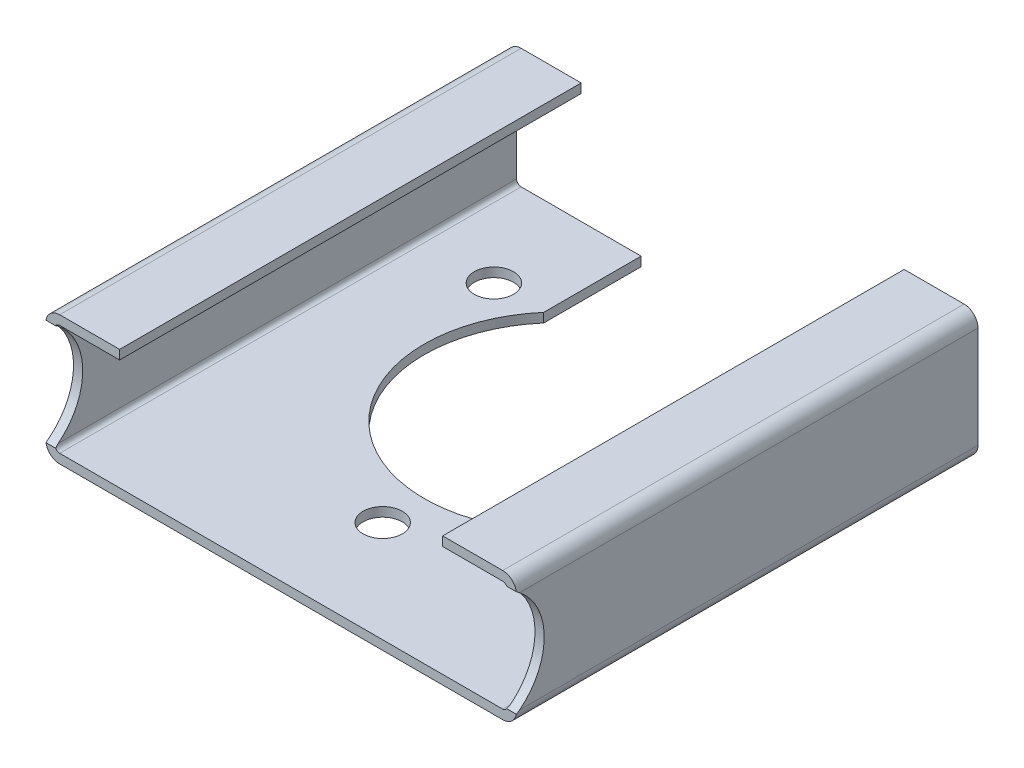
ISO-10303-21;
HEADER;
FILE_DESCRIPTION(('STEP AP214'),'2;1');
FILE_NAME('part.step','',(''),(''),'','','');
FILE_SCHEMA(('AUTOMOTIVE_DESIGN { 1 0 10303 214 1 1 1 1 }'));
ENDSEC;
DATA;
#1=APPLICATION_CONTEXT('core data for automotive mechanical design processes');
#2=APPLICATION_PROTOCOL_DEFINITION('international standard','automotive_design',2000,#1);
#3=PRODUCT_CONTEXT('',#1,'mechanical');
#4=PRODUCT('Part','Part','',(#3));
#5=PRODUCT_RELATED_PRODUCT_CATEGORY('part','',(#4));
#6=PRODUCT_DEFINITION_FORMATION('','',#4);
#7=PRODUCT_DEFINITION_CONTEXT('part definition',#1,'design');
#8=PRODUCT_DEFINITION('design','',#6,#7);
#9=PRODUCT_DEFINITION_SHAPE('','',#8);
#10=(LENGTH_UNIT() NAMED_UNIT(*) SI_UNIT(.MILLI.,.METRE.));
#11=(NAMED_UNIT(*) PLANE_ANGLE_UNIT() SI_UNIT($,.RADIAN.));
#12=(NAMED_UNIT(*) SI_UNIT($,.STERADIAN.) SOLID_ANGLE_UNIT());
#13=UNCERTAINTY_MEASURE_WITH_UNIT(LENGTH_MEASURE(1.E-05),#10,'distance_accuracy_value','');
#14=(GEOMETRIC_REPRESENTATION_CONTEXT(3) GLOBAL_UNCERTAINTY_ASSIGNED_CONTEXT((#13)) GLOBAL_UNIT_ASSIGNED_CONTEXT((#10,
#11,#12)) REPRESENTATION_CONTEXT('',''));
#15=CARTESIAN_POINT('',(0.,0.,0.));
#16=DIRECTION('',(0.,0.,1.));
#17=DIRECTION('',(1.,0.,0.));
#18=AXIS2_PLACEMENT_3D('',#15,#16,#17);
#19=CARTESIAN_POINT('',(3.,25.,-100.));
#20=DIRECTION('',(0.,0.,1.));
#21=DIRECTION('',(1.,0.,0.));
#22=AXIS2_PLACEMENT_3D('',#19,#20,#21);
#23=PLANE('',#22);
#24=DIRECTION('',(1.,0.,0.));
#25=VECTOR('',#24,1.);
#26=CARTESIAN_POINT('',(3.00000000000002,0.,-100.));
#27=LINE('',#26,#25);
#28=CARTESIAN_POINT('',(73.,0.,-100.));
#29=VERTEX_POINT('',#28);
#30=CARTESIAN_POINT('',(99.,0.,-100.));
#31=VERTEX_POINT('',#30);
#32=EDGE_CURVE('E236',#29,#31,#27,.T.);
#33=ORIENTED_EDGE('',*,*,#32,.F.);
#34=DIRECTION('',(0.,-1.,0.));
#35=VECTOR('',#34,1.);
#36=CARTESIAN_POINT('',(73.,28.001,-100.));
#37=LINE('',#36,#35);
#38=CARTESIAN_POINT('',(73.,2.,-100.));
#39=VERTEX_POINT('',#38);
#40=EDGE_CURVE('E220',#39,#29,#37,.T.);
#41=ORIENTED_EDGE('',*,*,#40,.F.);
#42=DIRECTION('',(-1.,0.,0.));
#43=VECTOR('',#42,1.);
#44=CARTESIAN_POINT('',(3.00000000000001,2.,-100.));
#45=LINE('',#44,#43);
#46=CARTESIAN_POINT('',(99.,2.,-100.));
#47=VERTEX_POINT('',#46);
#48=EDGE_CURVE('E233',#47,#39,#45,.T.);
#49=ORIENTED_EDGE('',*,*,#48,.F.);
#50=CARTESIAN_POINT('',(99.,3.,-100.));
#51=DIRECTION('',(0.,0.,-1.));
#52=DIRECTION('',(-1.,0.,0.));
#53=AXIS2_PLACEMENT_3D('',#50,#51,#52);
#54=CIRCLE('',#53,1.);
#55=CARTESIAN_POINT('',(100.,3.00000000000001,-100.));
#56=VERTEX_POINT('',#55);
#57=EDGE_CURVE('E249',#56,#47,#54,.T.);
#58=ORIENTED_EDGE('',*,*,#57,.F.);
#59=DIRECTION('',(0.,-1.,0.));
#60=VECTOR('',#59,1.);
#61=CARTESIAN_POINT('',(100.,3.00000000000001,-100.));
#62=LINE('',#61,#60);
#63=CARTESIAN_POINT('',(100.,25.,-100.));
#64=VERTEX_POINT('',#63);
#65=EDGE_CURVE('E408',#64,#56,#62,.T.);
#66=ORIENTED_EDGE('',*,*,#65,.F.);
#67=CARTESIAN_POINT('',(99.,25.,-100.));
#68=DIRECTION('',(0.,0.,-1.));
#69=DIRECTION('',(1.,0.,0.));
#70=AXIS2_PLACEMENT_3D('',#67,#68,#69);
#71=CIRCLE('',#70,1.);
#72=CARTESIAN_POINT('',(99.,26.,-100.));
#73=VERTEX_POINT('',#72);
#74=EDGE_CURVE('E406',#73,#64,#71,.T.);
#75=ORIENTED_EDGE('',*,*,#74,.F.);
#76=DIRECTION('',(1.,0.,0.));
#77=VECTOR('',#76,1.);
#78=CARTESIAN_POINT('',(86.,26.,-100.));
#79=LINE('',#78,#77);
#80=CARTESIAN_POINT('',(86.,26.,-100.));
#81=VERTEX_POINT('',#80);
#82=EDGE_CURVE('E403',#81,#73,#79,.T.);
#83=ORIENTED_EDGE('',*,*,#82,.F.);
#84=DIRECTION('',(0.,-1.,0.));
#85=VECTOR('',#84,1.);
#86=CARTESIAN_POINT('',(86.,28.,-100.));
#87=LINE('',#86,#85);
#88=CARTESIAN_POINT('',(86.,28.,-100.));
#89=VERTEX_POINT('',#88);
#90=EDGE_CURVE('E400',#89,#81,#87,.T.);
#91=ORIENTED_EDGE('',*,*,#90,.F.);
#92=DIRECTION('',(-1.,0.,0.));
#93=VECTOR('',#92,1.);
#94=CARTESIAN_POINT('',(86.,28.,-100.));
#95=LINE('',#94,#93);
#96=CARTESIAN_POINT('',(99.,28.,-100.));
#97=VERTEX_POINT('',#96);
#98=EDGE_CURVE('E397',#97,#89,#95,.T.);
#99=ORIENTED_EDGE('',*,*,#98,.F.);
#100=CARTESIAN_POINT('',(99.,25.,-100.));
#101=DIRECTION('',(0.,0.,1.));
#102=DIRECTION('',(-1.,0.,0.));
#103=AXIS2_PLACEMENT_3D('',#100,#101,#102);
#104=CIRCLE('',#103,3.);
#105=CARTESIAN_POINT('',(102.,25.,-100.));
#106=VERTEX_POINT('',#105);
#107=EDGE_CURVE('E394',#106,#97,#104,.T.);
#108=ORIENTED_EDGE('',*,*,#107,.F.);
#109=DIRECTION('',(0.,1.,0.));
#110=VECTOR('',#109,1.);
#111=CARTESIAN_POINT('',(102.,3.00000000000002,-100.));
#112=LINE('',#111,#110);
#113=CARTESIAN_POINT('',(102.,3.00000000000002,-100.));
#114=VERTEX_POINT('',#113);
#115=EDGE_CURVE('E391',#114,#106,#112,.T.);
#116=ORIENTED_EDGE('',*,*,#115,.F.);
#117=CARTESIAN_POINT('',(99.,3.,-100.));
#118=DIRECTION('',(0.,0.,1.));
#119=DIRECTION('',(-1.,0.,0.));
#120=AXIS2_PLACEMENT_3D('',#117,#118,#119);
#121=CIRCLE('',#120,3.);
#122=EDGE_CURVE('E389',#31,#114,#121,.T.);
#123=ORIENTED_EDGE('',*,*,#122,.F.);
#124=EDGE_LOOP('',(#33,#41,#49,#58,#66,#75,#83,#91,#99,#108,#116,#123));
#125=FACE_BOUND('',#124,.T.);
#126=ADVANCED_FACE('F32',(#125),#23,.F.);
#127=CARTESIAN_POINT('',(3.,25.,0.));
#128=DIRECTION('',(0.,0.,1.));
#129=DIRECTION('',(1.,0.,0.));
#130=AXIS2_PLACEMENT_3D('',#127,#128,#129);
#131=PLANE('',#130);
#132=DIRECTION('',(1.,0.,0.));
#133=VECTOR('',#132,1.);
#134=CARTESIAN_POINT('',(0.,2.51087470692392,0.));
#135=LINE('',#134,#133);
#136=CARTESIAN_POINT('',(0.0401424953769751,2.51087470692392,0.));
#137=VERTEX_POINT('',#136);
#138=CARTESIAN_POINT('',(2.12778646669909,2.51087470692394,0.));
#139=VERTEX_POINT('',#138);
#140=EDGE_CURVE('E11',#137,#139,#135,.T.);
#141=ORIENTED_EDGE('',*,*,#140,.F.);
#142=CARTESIAN_POINT('',(3.,3.,0.));
#143=DIRECTION('',(0.,0.,1.));
#144=DIRECTION('',(-1.,0.,0.));
#145=AXIS2_PLACEMENT_3D('',#142,#143,#144);
#146=CIRCLE('',#145,3.);
#147=CARTESIAN_POINT('',(3.00000000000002,0.,0.));
#148=VERTEX_POINT('',#147);
#149=EDGE_CURVE('E343',#137,#148,#146,.T.);
#150=ORIENTED_EDGE('',*,*,#149,.T.);
#151=DIRECTION('',(1.,0.,0.));
#152=VECTOR('',#151,1.);
#153=CARTESIAN_POINT('',(3.00000000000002,0.,0.));
#154=LINE('',#153,#152);
#155=CARTESIAN_POINT('',(99.,0.,0.));
#156=VERTEX_POINT('',#155);
#157=EDGE_CURVE('E338',#148,#156,#154,.T.);
#158=ORIENTED_EDGE('',*,*,#157,.T.);
#159=CARTESIAN_POINT('',(99.,3.,0.));
#160=DIRECTION('',(0.,0.,1.));
#161=DIRECTION('',(-1.,0.,0.));
#162=AXIS2_PLACEMENT_3D('',#159,#160,#161);
#163=CIRCLE('',#162,3.);
#164=CARTESIAN_POINT('',(101.959857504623,2.51087470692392,0.));
#165=VERTEX_POINT('',#164);
#166=EDGE_CURVE('E330',#156,#165,#163,.T.);
#167=ORIENTED_EDGE('',*,*,#166,.T.);
#168=CARTESIAN_POINT('',(99.8722135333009,2.51087470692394,0.));
#169=VERTEX_POINT('',#168);
#170=EDGE_CURVE('E36',#169,#165,#135,.T.);
#171=ORIENTED_EDGE('',*,*,#170,.F.);
#172=CARTESIAN_POINT('',(99.,3.,0.));
#173=DIRECTION('',(0.,0.,-1.));
#174=DIRECTION('',(-1.,0.,0.));
#175=AXIS2_PLACEMENT_3D('',#172,#173,#174);
#176=CIRCLE('',#175,1.);
#177=CARTESIAN_POINT('',(99.,2.,0.));
#178=VERTEX_POINT('',#177);
#179=EDGE_CURVE('E358',#169,#178,#176,.T.);
#180=ORIENTED_EDGE('',*,*,#179,.T.);
#181=DIRECTION('',(-1.,0.,0.));
#182=VECTOR('',#181,1.);
#183=CARTESIAN_POINT('',(3.00000000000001,2.,0.));
#184=LINE('',#183,#182);
#185=CARTESIAN_POINT('',(3.00000000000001,2.,0.));
#186=VERTEX_POINT('',#185);
#187=EDGE_CURVE('E360',#178,#186,#184,.T.);
#188=ORIENTED_EDGE('',*,*,#187,.T.);
#189=CARTESIAN_POINT('',(3.,3.,0.));
#190=DIRECTION('',(0.,0.,-1.));
#191=DIRECTION('',(-1.,0.,0.));
#192=AXIS2_PLACEMENT_3D('',#189,#190,#191);
#193=CIRCLE('',#192,1.);
#194=EDGE_CURVE('E363',#186,#139,#193,.T.);
#195=ORIENTED_EDGE('',*,*,#194,.T.);
#196=EDGE_LOOP('',(#141,#150,#158,#167,#171,#180,#188,#195));
#197=FACE_BOUND('',#196,.T.);
#198=ADVANCED_FACE('F336',(#197),#131,.T.);
#199=DIRECTION('',(1.,0.,0.));
#200=VECTOR('',#199,1.);
#201=CARTESIAN_POINT('',(0.,25.4891252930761,0.));
#202=LINE('',#201,#200);
#203=CARTESIAN_POINT('',(101.959857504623,25.4891252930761,0.));
#204=VERTEX_POINT('',#203);
#205=CARTESIAN_POINT('',(99.8722135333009,25.4891252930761,0.));
#206=VERTEX_POINT('',#205);
#207=EDGE_CURVE('E311',#204,#206,#202,.F.);
#208=ORIENTED_EDGE('',*,*,#207,.F.);
#209=CARTESIAN_POINT('',(99.,25.,0.));
#210=DIRECTION('',(0.,0.,1.));
#211=DIRECTION('',(-1.,0.,0.));
#212=AXIS2_PLACEMENT_3D('',#209,#210,#211);
#213=CIRCLE('',#212,3.);
#214=CARTESIAN_POINT('',(99.,28.,0.));
#215=VERTEX_POINT('',#214);
#216=EDGE_CURVE('E339',#204,#215,#213,.T.);
#217=ORIENTED_EDGE('',*,*,#216,.T.);
#218=DIRECTION('',(-1.,0.,0.));
#219=VECTOR('',#218,1.);
#220=CARTESIAN_POINT('',(86.,28.,0.));
#221=LINE('',#220,#219);
#222=CARTESIAN_POINT('',(86.,28.,0.));
#223=VERTEX_POINT('',#222);
#224=EDGE_CURVE('E341',#215,#223,#221,.T.);
#225=ORIENTED_EDGE('',*,*,#224,.T.);
#226=DIRECTION('',(0.,-1.,0.));
#227=VECTOR('',#226,1.);
#228=CARTESIAN_POINT('',(86.,28.,0.));
#229=LINE('',#228,#227);
#230=CARTESIAN_POINT('',(86.,26.,0.));
#231=VERTEX_POINT('',#230);
#232=EDGE_CURVE('E349',#223,#231,#229,.T.);
#233=ORIENTED_EDGE('',*,*,#232,.T.);
#234=DIRECTION('',(1.,0.,0.));
#235=VECTOR('',#234,1.);
#236=CARTESIAN_POINT('',(86.,26.,0.));
#237=LINE('',#236,#235);
#238=CARTESIAN_POINT('',(99.,26.,0.));
#239=VERTEX_POINT('',#238);
#240=EDGE_CURVE('E352',#231,#239,#237,.T.);
#241=ORIENTED_EDGE('',*,*,#240,.T.);
#242=CARTESIAN_POINT('',(99.,25.,0.));
#243=DIRECTION('',(0.,0.,-1.));
#244=DIRECTION('',(1.,0.,0.));
#245=AXIS2_PLACEMENT_3D('',#242,#243,#244);
#246=CIRCLE('',#245,1.);
#247=EDGE_CURVE('E355',#239,#206,#246,.T.);
#248=ORIENTED_EDGE('',*,*,#247,.T.);
#249=EDGE_LOOP('',(#208,#217,#225,#233,#241,#248));
#250=FACE_BOUND('',#249,.T.);
#251=ADVANCED_FACE('F566',(#250),#131,.T.);
#252=CARTESIAN_POINT('',(16.,28.,-100.));
#253=DIRECTION('',(1.,0.,0.));
#254=DIRECTION('',(0.,0.,-1.));
#255=AXIS2_PLACEMENT_3D('',#252,#253,#254);
#256=PLANE('',#255);
#257=DIRECTION('',(0.,1.,0.));
#258=VECTOR('',#257,1.);
#259=CARTESIAN_POINT('',(16.,28.,0.));
#260=LINE('',#259,#258);
#261=CARTESIAN_POINT('',(16.,26.,0.));
#262=VERTEX_POINT('',#261);
#263=CARTESIAN_POINT('',(16.,28.,0.));
#264=VERTEX_POINT('',#263);
#265=EDGE_CURVE('E333',#262,#264,#260,.T.);
#266=ORIENTED_EDGE('',*,*,#265,.F.);
#267=DIRECTION('',(0.,0.,1.));
#268=VECTOR('',#267,1.);
#269=CARTESIAN_POINT('',(16.,26.,-100.));
#270=LINE('',#269,#268);
#271=CARTESIAN_POINT('',(16.,26.,-100.));
#272=VERTEX_POINT('',#271);
#273=EDGE_CURVE('E262',#272,#262,#270,.T.);
#274=ORIENTED_EDGE('',*,*,#273,.F.);
#275=DIRECTION('',(0.,1.,0.));
#276=VECTOR('',#275,1.);
#277=CARTESIAN_POINT('',(16.,28.,-100.));
#278=LINE('',#277,#276);
#279=CARTESIAN_POINT('',(16.,28.,-100.));
#280=VERTEX_POINT('',#279);
#281=EDGE_CURVE('E371',#272,#280,#278,.T.);
#282=ORIENTED_EDGE('',*,*,#281,.T.);
#283=DIRECTION('',(0.,0.,1.));
#284=VECTOR('',#283,1.);
#285=CARTESIAN_POINT('',(16.,28.,-100.));
#286=LINE('',#285,#284);
#287=EDGE_CURVE('E261',#280,#264,#286,.T.);
#288=ORIENTED_EDGE('',*,*,#287,.T.);
#289=EDGE_LOOP('',(#266,#274,#282,#288));
#290=FACE_BOUND('',#289,.T.);
#291=ADVANCED_FACE('F34',(#290),#256,.T.);
#292=CARTESIAN_POINT('',(3.00000000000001,26.,-100.));
#293=DIRECTION('',(0.,-1.,0.));
#294=DIRECTION('',(1.,0.,0.));
#295=AXIS2_PLACEMENT_3D('',#292,#293,#294);
#296=PLANE('',#295);
#297=DIRECTION('',(1.,0.,0.));
#298=VECTOR('',#297,1.);
#299=CARTESIAN_POINT('',(3.00000000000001,26.,0.));
#300=LINE('',#299,#298);
#301=CARTESIAN_POINT('',(3.00000000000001,26.,0.));
#302=VERTEX_POINT('',#301);
#303=EDGE_CURVE('E368',#302,#262,#300,.T.);
#304=ORIENTED_EDGE('',*,*,#303,.F.);
#305=DIRECTION('',(0.,0.,1.));
#306=VECTOR('',#305,1.);
#307=CARTESIAN_POINT('',(3.00000000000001,26.,-100.));
#308=LINE('',#307,#306);
#309=CARTESIAN_POINT('',(3.00000000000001,26.,-100.));
#310=VERTEX_POINT('',#309);
#311=EDGE_CURVE('E265',#310,#302,#308,.T.);
#312=ORIENTED_EDGE('',*,*,#311,.F.);
#313=DIRECTION('',(1.,0.,0.));
#314=VECTOR('',#313,1.);
#315=CARTESIAN_POINT('',(3.00000000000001,26.,-100.));
#316=LINE('',#315,#314);
#317=EDGE_CURVE('E258',#310,#272,#316,.T.);
#318=ORIENTED_EDGE('',*,*,#317,.T.);
#319=ORIENTED_EDGE('',*,*,#273,.T.);
#320=EDGE_LOOP('',(#304,#312,#318,#319));
#321=FACE_BOUND('',#320,.T.);
#322=ADVANCED_FACE('F599',(#321),#296,.T.);
#323=CARTESIAN_POINT('',(3.,25.,-100.));
#324=DIRECTION('',(0.,0.,1.));
#325=DIRECTION('',(1.,0.,0.));
#326=AXIS2_PLACEMENT_3D('',#323,#324,#325);
#327=CYLINDRICAL_SURFACE('',#326,1.);
#328=CARTESIAN_POINT('',(2.,25.,-0.660254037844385));
#329=CARTESIAN_POINT('',(2.00002286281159,25.043179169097,-0.605415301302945));
#330=CARTESIAN_POINT('',(2.0027955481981,25.0859335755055,-0.550259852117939));
#331=CARTESIAN_POINT('',(2.01366186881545,25.1701108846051,-0.43998692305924));
#332=CARTESIAN_POINT('',(2.02172327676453,25.2115402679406,-0.384871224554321));
#333=CARTESIAN_POINT('',(2.04299250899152,25.2931130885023,-0.274677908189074));
#334=CARTESIAN_POINT('',(2.05620042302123,25.3332565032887,-0.21960029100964));
#335=CARTESIAN_POINT('',(2.08794805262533,25.4122735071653,-0.109541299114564));
#336=CARTESIAN_POINT('',(2.10651967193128,25.4511379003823,-0.0545625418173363));
#337=CARTESIAN_POINT('',(2.12778646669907,25.489125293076,0.));
#338=B_SPLINE_CURVE_WITH_KNOTS('',3,(#328,#329,#330,#331,#332,#333,#334,#335,#336,#337),
.UNSPECIFIED.,.F.,.F.,(4,2,2,2,4),(0.,0.209317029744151,0.417370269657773,0.625427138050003,
0.834747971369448),.UNSPECIFIED.);
#339=CARTESIAN_POINT('',(2.,25.,-0.660254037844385));
#340=VERTEX_POINT('',#339);
#341=CARTESIAN_POINT('',(2.12778646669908,25.4891252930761,0.));
#342=VERTEX_POINT('',#341);
#343=EDGE_CURVE('E55',#340,#342,#338,.T.);
#344=ORIENTED_EDGE('',*,*,#343,.F.);
#345=DIRECTION('',(0.,0.,1.));
#346=VECTOR('',#345,1.);
#347=CARTESIAN_POINT('',(2.,25.,-100.));
#348=LINE('',#347,#346);
#349=CARTESIAN_POINT('',(2.,25.,-100.));
#350=VERTEX_POINT('',#349);
#351=EDGE_CURVE('E268',#350,#340,#348,.T.);
#352=ORIENTED_EDGE('',*,*,#351,.F.);
#353=CARTESIAN_POINT('',(3.,25.,-100.));
#354=DIRECTION('',(0.,0.,-1.));
#355=DIRECTION('',(1.,0.,0.));
#356=AXIS2_PLACEMENT_3D('',#353,#354,#355);
#357=CIRCLE('',#356,1.);
#358=EDGE_CURVE('E255',#350,#310,#357,.T.);
#359=ORIENTED_EDGE('',*,*,#358,.T.);
#360=ORIENTED_EDGE('',*,*,#311,.T.);
#361=CARTESIAN_POINT('',(3.,25.,0.));
#362=DIRECTION('',(0.,0.,-1.));
#363=DIRECTION('',(1.,0.,0.));
#364=AXIS2_PLACEMENT_3D('',#361,#362,#363);
#365=CIRCLE('',#364,1.);
#366=EDGE_CURVE('E366',#342,#302,#365,.T.);
#367=ORIENTED_EDGE('',*,*,#366,.F.);
#368=EDGE_LOOP('',(#344,#352,#359,#360,#367));
#369=FACE_BOUND('',#368,.T.);
#370=ADVANCED_FACE('F592',(#369),#327,.F.);
#371=CARTESIAN_POINT('',(2.,3.00000000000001,-100.));
#372=DIRECTION('',(1.,0.,0.));
#373=DIRECTION('',(0.,0.,-1.));
#374=AXIS2_PLACEMENT_3D('',#371,#372,#373);
#375=PLANE('',#374);
#376=CARTESIAN_POINT('',(2.,14.,7.99999999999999));
#377=DIRECTION('',(1.,0.,0.));
#378=DIRECTION('',(0.,0.,-1.));
#379=AXIS2_PLACEMENT_3D('',#376,#377,#378);
#380=CIRCLE('',#379,14.);
#381=CARTESIAN_POINT('',(2.,3.00000000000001,-0.660254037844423));
#382=VERTEX_POINT('',#381);
#383=EDGE_CURVE('E587',#382,#340,#380,.T.);
#384=ORIENTED_EDGE('',*,*,#383,.F.);
#385=DIRECTION('',(0.,0.,1.));
#386=VECTOR('',#385,1.);
#387=CARTESIAN_POINT('',(2.,3.00000000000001,-100.));
#388=LINE('',#387,#386);
#389=CARTESIAN_POINT('',(2.,3.00000000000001,-100.));
#390=VERTEX_POINT('',#389);
#391=EDGE_CURVE('E271',#390,#382,#388,.T.);
#392=ORIENTED_EDGE('',*,*,#391,.F.);
#393=DIRECTION('',(0.,1.,0.));
#394=VECTOR('',#393,1.);
#395=CARTESIAN_POINT('',(2.,3.00000000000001,-100.));
#396=LINE('',#395,#394);
#397=EDGE_CURVE('E247',#390,#350,#396,.T.);
#398=ORIENTED_EDGE('',*,*,#397,.T.);
#399=ORIENTED_EDGE('',*,*,#351,.T.);
#400=EDGE_LOOP('',(#384,#392,#398,#399));
#401=FACE_BOUND('',#400,.T.);
#402=ADVANCED_FACE('F594',(#401),#375,.T.);
#403=CARTESIAN_POINT('',(3.,3.,-100.));
#404=DIRECTION('',(0.,0.,1.));
#405=DIRECTION('',(1.,0.,0.));
#406=AXIS2_PLACEMENT_3D('',#403,#404,#405);
#407=CYLINDRICAL_SURFACE('',#406,1.);
#408=CARTESIAN_POINT('',(2.12778646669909,2.51087470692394,0.));
#409=CARTESIAN_POINT('',(2.10651967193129,2.54886209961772,-0.0545625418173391));
#410=CARTESIAN_POINT('',(2.08794805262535,2.58772649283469,-0.109541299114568));
#411=CARTESIAN_POINT('',(2.05620042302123,2.66674349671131,-0.21960029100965));
#412=CARTESIAN_POINT('',(2.04299250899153,2.70688691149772,-0.274677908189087));
#413=CARTESIAN_POINT('',(2.02172327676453,2.78845973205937,-0.384871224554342));
#414=CARTESIAN_POINT('',(2.01366186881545,2.82988911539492,-0.439986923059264));
#415=CARTESIAN_POINT('',(2.0027955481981,2.9140664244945,-0.550259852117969));
#416=CARTESIAN_POINT('',(2.00002286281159,2.95682083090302,-0.605415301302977));
#417=CARTESIAN_POINT('',(2.,3.00000000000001,-0.66025403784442));
#418=B_SPLINE_CURVE_WITH_KNOTS('',3,(#408,#409,#410,#411,#412,#413,#414,#415,#416,#417),
.UNSPECIFIED.,.F.,.F.,(4,2,2,2,4),(0.,0.209320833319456,0.417377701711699,0.625430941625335,
0.834747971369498),.UNSPECIFIED.);
#419=EDGE_CURVE('E490',#139,#382,#418,.T.);
#420=ORIENTED_EDGE('',*,*,#419,.F.);
#421=ORIENTED_EDGE('',*,*,#194,.F.);
#422=DIRECTION('',(0.,0.,1.));
#423=VECTOR('',#422,1.);
#424=CARTESIAN_POINT('',(3.00000000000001,2.,-100.));
#425=LINE('',#424,#423);
#426=CARTESIAN_POINT('',(3.00000000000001,2.,-100.));
#427=VERTEX_POINT('',#426);
#428=EDGE_CURVE('E274',#427,#186,#425,.T.);
#429=ORIENTED_EDGE('',*,*,#428,.F.);
#430=CARTESIAN_POINT('',(3.,3.,-100.));
#431=DIRECTION('',(0.,0.,-1.));
#432=DIRECTION('',(-1.,0.,0.));
#433=AXIS2_PLACEMENT_3D('',#430,#431,#432);
#434=CIRCLE('',#433,1.);
#435=EDGE_CURVE('E243',#427,#390,#434,.T.);
#436=ORIENTED_EDGE('',*,*,#435,.T.);
#437=ORIENTED_EDGE('',*,*,#391,.T.);
#438=EDGE_LOOP('',(#420,#421,#429,#436,#437));
#439=FACE_BOUND('',#438,.T.);
#440=ADVANCED_FACE('F584',(#439),#407,.F.);
#441=CARTESIAN_POINT('',(3.00000000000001,2.,-100.));
#442=DIRECTION('',(0.,1.,0.));
#443=DIRECTION('',(0.,0.,1.));
#444=AXIS2_PLACEMENT_3D('',#441,#442,#443);
#445=PLANE('',#444);
#446=CARTESIAN_POINT('',(18.0910346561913,2.,-78.9999999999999));
#447=DIRECTION('',(0.,1.,0.));
#448=DIRECTION('',(0.,0.,1.));
#449=AXIS2_PLACEMENT_3D('',#446,#447,#448);
#450=CIRCLE('',#449,4.25000000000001);
#451=CARTESIAN_POINT('',(18.0910346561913,2.,-83.2499999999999));
#452=VERTEX_POINT('',#451);
#453=EDGE_CURVE('E838',#452,#452,#450,.F.);
#454=ORIENTED_EDGE('',*,*,#453,.T.);
#455=EDGE_LOOP('',(#454));
#456=FACE_BOUND('',#455,.T.);
#457=CARTESIAN_POINT('',(83.9089653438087,2.,-79.));
#458=DIRECTION('',(0.,1.,0.));
#459=DIRECTION('',(0.,0.,1.));
#460=AXIS2_PLACEMENT_3D('',#457,#458,#459);
#461=CIRCLE('',#460,4.25000000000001);
#462=CARTESIAN_POINT('',(83.9089653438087,2.,-83.25));
#463=VERTEX_POINT('',#462);
#464=EDGE_CURVE('E842',#463,#463,#461,.F.);
#465=ORIENTED_EDGE('',*,*,#464,.T.);
#466=EDGE_LOOP('',(#465));
#467=FACE_BOUND('',#466,.T.);
#468=CARTESIAN_POINT('',(51.,2.,-22.));
#469=DIRECTION('',(0.,1.,0.));
#470=DIRECTION('',(0.,0.,1.));
#471=AXIS2_PLACEMENT_3D('',#468,#469,#470);
#472=CIRCLE('',#471,4.25);
#473=CARTESIAN_POINT('',(51.,2.,-26.25));
#474=VERTEX_POINT('',#473);
#475=EDGE_CURVE('E845',#474,#474,#472,.F.);
#476=ORIENTED_EDGE('',*,*,#475,.T.);
#477=EDGE_LOOP('',(#476));
#478=FACE_BOUND('',#477,.T.);
#479=DIRECTION('',(0.,0.,1.));
#480=VECTOR('',#479,1.);
#481=CARTESIAN_POINT('',(73.,2.,-78.8944436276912));
#482=LINE('',#481,#480);
#483=CARTESIAN_POINT('',(73.,2.,-78.8944436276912));
#484=VERTEX_POINT('',#483);
#485=EDGE_CURVE('E216',#39,#484,#482,.T.);
#486=ORIENTED_EDGE('',*,*,#485,.T.);
#487=CARTESIAN_POINT('',(51.,2.,-60.));
#488=DIRECTION('',(0.,1.,0.));
#489=DIRECTION('',(0.,0.,1.));
#490=AXIS2_PLACEMENT_3D('',#487,#488,#489);
#491=CIRCLE('',#490,29.);
#492=CARTESIAN_POINT('',(29.,2.,-78.8944436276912));
#493=VERTEX_POINT('',#492);
#494=EDGE_CURVE('E227',#484,#493,#491,.F.);
#495=ORIENTED_EDGE('',*,*,#494,.T.);
#496=DIRECTION('',(0.,0.,-1.));
#497=VECTOR('',#496,1.);
#498=CARTESIAN_POINT('',(29.,2.,-78.8944436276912));
#499=LINE('',#498,#497);
#500=CARTESIAN_POINT('',(29.,2.00000000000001,-100.));
#501=VERTEX_POINT('',#500);
#502=EDGE_CURVE('E451',#493,#501,#499,.T.);
#503=ORIENTED_EDGE('',*,*,#502,.T.);
#504=EDGE_CURVE('E244',#501,#427,#45,.T.);
#505=ORIENTED_EDGE('',*,*,#504,.T.);
#506=ORIENTED_EDGE('',*,*,#428,.T.);
#507=ORIENTED_EDGE('',*,*,#187,.F.);
#508=DIRECTION('',(0.,0.,1.));
#509=VECTOR('',#508,1.);
#510=CARTESIAN_POINT('',(99.,2.,-100.));
#511=LINE('',#510,#509);
#512=EDGE_CURVE('E242',#47,#178,#511,.T.);
#513=ORIENTED_EDGE('',*,*,#512,.F.);
#514=ORIENTED_EDGE('',*,*,#48,.T.);
#515=EDGE_LOOP('',(#486,#495,#503,#505,#506,#507,#513,#514));
#516=FACE_BOUND('',#515,.T.);
#517=ADVANCED_FACE('F239',(#456,#467,#478,#516),#445,.T.);
#518=CARTESIAN_POINT('',(99.,3.,-100.));
#519=DIRECTION('',(0.,0.,1.));
#520=DIRECTION('',(1.,0.,0.));
#521=AXIS2_PLACEMENT_3D('',#518,#519,#520);
#522=CYLINDRICAL_SURFACE('',#521,1.);
#523=CARTESIAN_POINT('',(100.,3.00000000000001,-0.660254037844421));
#524=CARTESIAN_POINT('',(99.9999771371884,2.95682083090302,-0.605415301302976));
#525=CARTESIAN_POINT('',(99.9972044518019,2.9140664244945,-0.550259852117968));
#526=CARTESIAN_POINT('',(99.9863381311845,2.82988911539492,-0.439986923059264));
#527=CARTESIAN_POINT('',(99.9782767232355,2.78845973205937,-0.384871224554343));
#528=CARTESIAN_POINT('',(99.9570074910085,2.70688691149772,-0.274677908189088));
#529=CARTESIAN_POINT('',(99.9437995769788,2.66674349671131,-0.219600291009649));
#530=CARTESIAN_POINT('',(99.9120519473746,2.58772649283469,-0.109541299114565));
#531=CARTESIAN_POINT('',(99.8934803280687,2.54886209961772,-0.0545625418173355));
#532=CARTESIAN_POINT('',(99.8722135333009,2.51087470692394,0.));
#533=B_SPLINE_CURVE_WITH_KNOTS('',3,(#523,#524,#525,#526,#527,#528,#529,#530,#531,#532),
.UNSPECIFIED.,.F.,.F.,(4,2,2,2,4),(0.,0.209317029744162,0.417370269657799,0.625427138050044,
0.834747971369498),.UNSPECIFIED.);
#534=CARTESIAN_POINT('',(100.,3.00000000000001,-0.660254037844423));
#535=VERTEX_POINT('',#534);
#536=EDGE_CURVE('E322',#535,#169,#533,.T.);
#537=ORIENTED_EDGE('',*,*,#536,.F.);
#538=DIRECTION('',(0.,0.,1.));
#539=VECTOR('',#538,1.);
#540=CARTESIAN_POINT('',(100.,3.00000000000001,-100.));
#541=LINE('',#540,#539);
#542=EDGE_CURVE('E277',#56,#535,#541,.T.);
#543=ORIENTED_EDGE('',*,*,#542,.F.);
#544=ORIENTED_EDGE('',*,*,#57,.T.);
#545=ORIENTED_EDGE('',*,*,#512,.T.);
#546=ORIENTED_EDGE('',*,*,#179,.F.);
#547=EDGE_LOOP('',(#537,#543,#544,#545,#546));
#548=FACE_BOUND('',#547,.T.);
#549=ADVANCED_FACE('F413',(#548),#522,.F.);
#550=CARTESIAN_POINT('',(100.,3.00000000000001,-100.));
#551=DIRECTION('',(-1.,0.,0.));
#552=DIRECTION('',(0.,0.,1.));
#553=AXIS2_PLACEMENT_3D('',#550,#551,#552);
#554=PLANE('',#553);
#555=CARTESIAN_POINT('',(100.,14.,7.99999999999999));
#556=DIRECTION('',(-1.,0.,0.));
#557=DIRECTION('',(0.,0.,1.));
#558=AXIS2_PLACEMENT_3D('',#555,#556,#557);
#559=CIRCLE('',#558,14.);
#560=CARTESIAN_POINT('',(100.,25.,-0.660254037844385));
#561=VERTEX_POINT('',#560);
#562=EDGE_CURVE('E520',#561,#535,#559,.T.);
#563=ORIENTED_EDGE('',*,*,#562,.F.);
#564=DIRECTION('',(0.,0.,1.));
#565=VECTOR('',#564,1.);
#566=CARTESIAN_POINT('',(100.,25.,-100.));
#567=LINE('',#566,#565);
#568=EDGE_CURVE('E280',#64,#561,#567,.T.);
#569=ORIENTED_EDGE('',*,*,#568,.F.);
#570=ORIENTED_EDGE('',*,*,#65,.T.);
#571=ORIENTED_EDGE('',*,*,#542,.T.);
#572=EDGE_LOOP('',(#563,#569,#570,#571));
#573=FACE_BOUND('',#572,.T.);
#574=ADVANCED_FACE('F530',(#573),#554,.T.);
#575=CARTESIAN_POINT('',(99.,25.,-100.));
#576=DIRECTION('',(0.,0.,1.));
#577=DIRECTION('',(1.,0.,0.));
#578=AXIS2_PLACEMENT_3D('',#575,#576,#577);
#579=CYLINDRICAL_SURFACE('',#578,1.);
#580=CARTESIAN_POINT('',(99.8722135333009,25.489125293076,0.));
#581=CARTESIAN_POINT('',(99.8934803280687,25.4511379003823,-0.0545625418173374));
#582=CARTESIAN_POINT('',(99.9120519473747,25.4122735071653,-0.109541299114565));
#583=CARTESIAN_POINT('',(99.9437995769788,25.3332565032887,-0.219600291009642));
#584=CARTESIAN_POINT('',(99.9570074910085,25.2931130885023,-0.274677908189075));
#585=CARTESIAN_POINT('',(99.9782767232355,25.2115402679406,-0.384871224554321));
#586=CARTESIAN_POINT('',(99.9863381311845,25.1701108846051,-0.439986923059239));
#587=CARTESIAN_POINT('',(99.9972044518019,25.0859335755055,-0.550259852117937));
#588=CARTESIAN_POINT('',(99.9999771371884,25.043179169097,-0.605415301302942));
#589=CARTESIAN_POINT('',(100.,25.,-0.660254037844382));
#590=B_SPLINE_CURVE_WITH_KNOTS('',3,(#580,#581,#582,#583,#584,#585,#586,#587,#588,#589),
.UNSPECIFIED.,.F.,.F.,(4,2,2,2,4),(0.,0.209320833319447,0.417377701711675,0.625430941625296,
0.834747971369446),.UNSPECIFIED.);
#591=EDGE_CURVE('E509',#206,#561,#590,.T.);
#592=ORIENTED_EDGE('',*,*,#591,.F.);
#593=ORIENTED_EDGE('',*,*,#247,.F.);
#594=DIRECTION('',(0.,0.,1.));
#595=VECTOR('',#594,1.);
#596=CARTESIAN_POINT('',(99.,26.,-100.));
#597=LINE('',#596,#595);
#598=EDGE_CURVE('E283',#73,#239,#597,.T.);
#599=ORIENTED_EDGE('',*,*,#598,.F.);
#600=ORIENTED_EDGE('',*,*,#74,.T.);
#601=ORIENTED_EDGE('',*,*,#568,.T.);
#602=EDGE_LOOP('',(#592,#593,#599,#600,#601));
#603=FACE_BOUND('',#602,.T.);
#604=ADVANCED_FACE('F417',(#603),#579,.F.);
#605=CARTESIAN_POINT('',(86.,26.,-100.));
#606=DIRECTION('',(0.,-1.,0.));
#607=DIRECTION('',(1.,0.,0.));
#608=AXIS2_PLACEMENT_3D('',#605,#606,#607);
#609=PLANE('',#608);
#610=ORIENTED_EDGE('',*,*,#240,.F.);
#611=DIRECTION('',(0.,0.,1.));
#612=VECTOR('',#611,1.);
#613=CARTESIAN_POINT('',(86.,26.,-100.));
#614=LINE('',#613,#612);
#615=EDGE_CURVE('E285',#81,#231,#614,.T.);
#616=ORIENTED_EDGE('',*,*,#615,.F.);
#617=ORIENTED_EDGE('',*,*,#82,.T.);
#618=ORIENTED_EDGE('',*,*,#598,.T.);
#619=EDGE_LOOP('',(#610,#616,#617,#618));
#620=FACE_BOUND('',#619,.T.);
#621=ADVANCED_FACE('F421',(#620),#609,.T.);
#622=CARTESIAN_POINT('',(86.,28.,-100.));
#623=DIRECTION('',(-1.,0.,0.));
#624=DIRECTION('',(0.,0.,1.));
#625=AXIS2_PLACEMENT_3D('',#622,#623,#624);
#626=PLANE('',#625);
#627=ORIENTED_EDGE('',*,*,#232,.F.);
#628=DIRECTION('',(0.,0.,1.));
#629=VECTOR('',#628,1.);
#630=CARTESIAN_POINT('',(86.,28.,-100.));
#631=LINE('',#630,#629);
#632=EDGE_CURVE('E287',#89,#223,#631,.T.);
#633=ORIENTED_EDGE('',*,*,#632,.F.);
#634=ORIENTED_EDGE('',*,*,#90,.T.);
#635=ORIENTED_EDGE('',*,*,#615,.T.);
#636=EDGE_LOOP('',(#627,#633,#634,#635));
#637=FACE_BOUND('',#636,.T.);
#638=ADVANCED_FACE('F426',(#637),#626,.T.);
#639=CARTESIAN_POINT('',(86.,28.,-100.));
#640=DIRECTION('',(0.,1.,0.));
#641=DIRECTION('',(0.,0.,1.));
#642=AXIS2_PLACEMENT_3D('',#639,#640,#641);
#643=PLANE('',#642);
#644=ORIENTED_EDGE('',*,*,#224,.F.);
#645=DIRECTION('',(0.,0.,1.));
#646=VECTOR('',#645,1.);
#647=CARTESIAN_POINT('',(99.,28.,-100.));
#648=LINE('',#647,#646);
#649=EDGE_CURVE('E289',#97,#215,#648,.T.);
#650=ORIENTED_EDGE('',*,*,#649,.F.);
#651=ORIENTED_EDGE('',*,*,#98,.T.);
#652=ORIENTED_EDGE('',*,*,#632,.T.);
#653=EDGE_LOOP('',(#644,#650,#651,#652));
#654=FACE_BOUND('',#653,.T.);
#655=ADVANCED_FACE('F429',(#654),#643,.T.);
#656=CARTESIAN_POINT('',(99.,25.,-100.));
#657=DIRECTION('',(0.,0.,1.));
#658=DIRECTION('',(1.,0.,0.));
#659=AXIS2_PLACEMENT_3D('',#656,#657,#658);
#660=CYLINDRICAL_SURFACE('',#659,3.);
#661=CARTESIAN_POINT('',(102.,25.,-0.660254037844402));
#662=CARTESIAN_POINT('',(101.999999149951,25.0424477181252,-0.606338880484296));
#663=CARTESIAN_POINT('',(101.999099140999,25.0844968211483,-0.552113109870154));
#664=CARTESIAN_POINT('',(101.995596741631,25.1677357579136,-0.443125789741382));
#665=CARTESIAN_POINT('',(101.992995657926,25.2089262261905,-0.388364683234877));
#666=CARTESIAN_POINT('',(101.986186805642,25.2904504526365,-0.278310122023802));
#667=CARTESIAN_POINT('',(101.981979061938,25.3307842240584,-0.223016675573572));
#668=CARTESIAN_POINT('',(101.97203998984,25.4106044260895,-0.111892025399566));
#669=CARTESIAN_POINT('',(101.966307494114,25.4500901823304,-0.0560604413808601));
#670=CARTESIAN_POINT('',(101.959857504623,25.489125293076,0.));
#671=B_SPLINE_CURVE_WITH_KNOTS('',3,(#661,#662,#663,#664,#665,#666,#667,#668,#669,#670),
.UNSPECIFIED.,.F.,.F.,(4,2,2,2,4),(0.,0.205847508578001,0.411537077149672,0.617223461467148,
0.823067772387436),.UNSPECIFIED.);
#672=CARTESIAN_POINT('',(102.,25.,-0.660254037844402));
#673=VERTEX_POINT('',#672);
#674=EDGE_CURVE('E436',#673,#204,#671,.T.);
#675=ORIENTED_EDGE('',*,*,#674,.F.);
#676=DIRECTION('',(0.,0.,1.));
#677=VECTOR('',#676,1.);
#678=CARTESIAN_POINT('',(102.,25.,-100.));
#679=LINE('',#678,#677);
#680=EDGE_CURVE('E292',#106,#673,#679,.T.);
#681=ORIENTED_EDGE('',*,*,#680,.F.);
#682=ORIENTED_EDGE('',*,*,#107,.T.);
#683=ORIENTED_EDGE('',*,*,#649,.T.);
#684=ORIENTED_EDGE('',*,*,#216,.F.);
#685=EDGE_LOOP('',(#675,#681,#682,#683,#684));
#686=FACE_BOUND('',#685,.T.);
#687=ADVANCED_FACE('F434',(#686),#660,.T.);
#688=CARTESIAN_POINT('',(102.,3.00000000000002,-100.));
#689=DIRECTION('',(1.,0.,0.));
#690=DIRECTION('',(0.,0.,-1.));
#691=AXIS2_PLACEMENT_3D('',#688,#689,#690);
#692=PLANE('',#691);
#693=CARTESIAN_POINT('',(102.,14.,7.99999999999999));
#694=DIRECTION('',(1.,0.,0.));
#695=DIRECTION('',(0.,0.,-1.));
#696=AXIS2_PLACEMENT_3D('',#693,#694,#695);
#697=CIRCLE('',#696,14.);
#698=CARTESIAN_POINT('',(102.,3.,-0.660254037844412));
#699=VERTEX_POINT('',#698);
#700=EDGE_CURVE('E439',#699,#673,#697,.T.);
#701=ORIENTED_EDGE('',*,*,#700,.F.);
#702=DIRECTION('',(0.,0.,1.));
#703=VECTOR('',#702,1.);
#704=CARTESIAN_POINT('',(102.,3.00000000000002,-100.));
#705=LINE('',#704,#703);
#706=EDGE_CURVE('E295',#114,#699,#705,.T.);
#707=ORIENTED_EDGE('',*,*,#706,.F.);
#708=ORIENTED_EDGE('',*,*,#115,.T.);
#709=ORIENTED_EDGE('',*,*,#680,.T.);
#710=EDGE_LOOP('',(#701,#707,#708,#709));
#711=FACE_BOUND('',#710,.T.);
#712=ADVANCED_FACE('F438',(#711),#692,.T.);
#713=CARTESIAN_POINT('',(99.,3.,-100.));
#714=DIRECTION('',(0.,0.,1.));
#715=DIRECTION('',(1.,0.,0.));
#716=AXIS2_PLACEMENT_3D('',#713,#714,#715);
#717=CYLINDRICAL_SURFACE('',#716,3.);
#718=CARTESIAN_POINT('',(101.959857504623,2.51087470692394,0.));
#719=CARTESIAN_POINT('',(101.966307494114,2.54990981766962,-0.0560604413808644));
#720=CARTESIAN_POINT('',(101.97203998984,2.58939557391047,-0.111892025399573));
#721=CARTESIAN_POINT('',(101.981979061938,2.66921577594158,-0.223016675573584));
#722=CARTESIAN_POINT('',(101.986186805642,2.70954954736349,-0.278310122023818));
#723=CARTESIAN_POINT('',(101.992995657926,2.79107377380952,-0.388364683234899));
#724=CARTESIAN_POINT('',(101.995596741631,2.83226424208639,-0.443125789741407));
#725=CARTESIAN_POINT('',(101.999099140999,2.91550317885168,-0.552113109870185));
#726=CARTESIAN_POINT('',(101.999999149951,2.95755228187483,-0.60633888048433));
#727=CARTESIAN_POINT('',(102.,3.00000000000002,-0.66025403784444));
#728=B_SPLINE_CURVE_WITH_KNOTS('',3,(#718,#719,#720,#721,#722,#723,#724,#725,#726,#727),
.UNSPECIFIED.,.F.,.F.,(4,2,2,2,4),(0.,0.205844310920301,0.411530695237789,0.617220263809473,
0.823067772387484),.UNSPECIFIED.);
#729=EDGE_CURVE('E319',#165,#699,#728,.T.);
#730=ORIENTED_EDGE('',*,*,#729,.F.);
#731=ORIENTED_EDGE('',*,*,#166,.F.);
#732=DIRECTION('',(0.,0.,1.));
#733=VECTOR('',#732,1.);
#734=CARTESIAN_POINT('',(99.,0.,-100.));
#735=LINE('',#734,#733);
#736=EDGE_CURVE('E298',#31,#156,#735,.T.);
#737=ORIENTED_EDGE('',*,*,#736,.F.);
#738=ORIENTED_EDGE('',*,*,#122,.T.);
#739=ORIENTED_EDGE('',*,*,#706,.T.);
#740=EDGE_LOOP('',(#730,#731,#737,#738,#739));
#741=FACE_BOUND('',#740,.T.);
#742=ADVANCED_FACE('F328',(#741),#717,.T.);
#743=CARTESIAN_POINT('',(3.00000000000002,0.,-100.));
#744=DIRECTION('',(0.,-1.,0.));
#745=DIRECTION('',(0.,0.,-1.));
#746=AXIS2_PLACEMENT_3D('',#743,#744,#745);
#747=PLANE('',#746);
#748=CARTESIAN_POINT('',(18.0910346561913,0.,-78.9999999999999));
#749=DIRECTION('',(0.,-1.,0.));
#750=DIRECTION('',(0.,0.,-1.));
#751=AXIS2_PLACEMENT_3D('',#748,#749,#750);
#752=CIRCLE('',#751,4.25000000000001);
#753=CARTESIAN_POINT('',(18.0910346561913,0.,-83.2499999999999));
#754=VERTEX_POINT('',#753);
#755=EDGE_CURVE('E856',#754,#754,#752,.T.);
#756=ORIENTED_EDGE('',*,*,#755,.F.);
#757=EDGE_LOOP('',(#756));
#758=FACE_BOUND('',#757,.T.);
#759=CARTESIAN_POINT('',(83.9089653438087,0.,-79.));
#760=DIRECTION('',(0.,-1.,0.));
#761=DIRECTION('',(0.,0.,-1.));
#762=AXIS2_PLACEMENT_3D('',#759,#760,#761);
#763=CIRCLE('',#762,4.25000000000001);
#764=CARTESIAN_POINT('',(83.9089653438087,0.,-83.25));
#765=VERTEX_POINT('',#764);
#766=EDGE_CURVE('E847',#765,#765,#763,.T.);
#767=ORIENTED_EDGE('',*,*,#766,.F.);
#768=EDGE_LOOP('',(#767));
#769=FACE_BOUND('',#768,.T.);
#770=CARTESIAN_POINT('',(51.,0.,-22.));
#771=DIRECTION('',(0.,-1.,0.));
#772=DIRECTION('',(0.,0.,-1.));
#773=AXIS2_PLACEMENT_3D('',#770,#771,#772);
#774=CIRCLE('',#773,4.25);
#775=CARTESIAN_POINT('',(51.,0.,-26.25));
#776=VERTEX_POINT('',#775);
#777=EDGE_CURVE('E846',#776,#776,#774,.T.);
#778=ORIENTED_EDGE('',*,*,#777,.F.);
#779=EDGE_LOOP('',(#778));
#780=FACE_BOUND('',#779,.T.);
#781=DIRECTION('',(0.,0.,1.));
#782=VECTOR('',#781,1.);
#783=CARTESIAN_POINT('',(73.,0.,-78.8944436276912));
#784=LINE('',#783,#782);
#785=CARTESIAN_POINT('',(73.,0.,-78.8944436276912));
#786=VERTEX_POINT('',#785);
#787=EDGE_CURVE('E443',#29,#786,#784,.T.);
#788=ORIENTED_EDGE('',*,*,#787,.F.);
#789=ORIENTED_EDGE('',*,*,#32,.T.);
#790=ORIENTED_EDGE('',*,*,#736,.T.);
#791=ORIENTED_EDGE('',*,*,#157,.F.);
#792=DIRECTION('',(0.,0.,1.));
#793=VECTOR('',#792,1.);
#794=CARTESIAN_POINT('',(3.00000000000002,0.,-100.));
#795=LINE('',#794,#793);
#796=CARTESIAN_POINT('',(3.00000000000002,0.,-100.));
#797=VERTEX_POINT('',#796);
#798=EDGE_CURVE('E300',#797,#148,#795,.T.);
#799=ORIENTED_EDGE('',*,*,#798,.F.);
#800=CARTESIAN_POINT('',(29.,0.,-100.));
#801=VERTEX_POINT('',#800);
#802=EDGE_CURVE('E386',#797,#801,#27,.T.);
#803=ORIENTED_EDGE('',*,*,#802,.T.);
#804=DIRECTION('',(0.,0.,-1.));
#805=VECTOR('',#804,1.);
#806=CARTESIAN_POINT('',(29.,0.,-78.8944436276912));
#807=LINE('',#806,#805);
#808=CARTESIAN_POINT('',(29.,0.,-78.8944436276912));
#809=VERTEX_POINT('',#808);
#810=EDGE_CURVE('E47',#809,#801,#807,.T.);
#811=ORIENTED_EDGE('',*,*,#810,.F.);
#812=CARTESIAN_POINT('',(51.,0.,-60.));
#813=DIRECTION('',(0.,-1.,0.));
#814=DIRECTION('',(0.,0.,-1.));
#815=AXIS2_PLACEMENT_3D('',#812,#813,#814);
#816=CIRCLE('',#815,29.);
#817=EDGE_CURVE('E226',#786,#809,#816,.T.);
#818=ORIENTED_EDGE('',*,*,#817,.F.);
#819=EDGE_LOOP('',(#788,#789,#790,#791,#799,#803,#811,#818));
#820=FACE_BOUND('',#819,.T.);
#821=ADVANCED_FACE('F441',(#758,#769,#780,#820),#747,.T.);
#822=CARTESIAN_POINT('',(3.,3.,-100.));
#823=DIRECTION('',(0.,0.,1.));
#824=DIRECTION('',(1.,0.,0.));
#825=AXIS2_PLACEMENT_3D('',#822,#823,#824);
#826=CYLINDRICAL_SURFACE('',#825,3.);
#827=CARTESIAN_POINT('',(0.,3.00000000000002,-0.660254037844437));
#828=CARTESIAN_POINT('',(8.50049454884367E-07,2.95755228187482,-0.606338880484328));
#829=CARTESIAN_POINT('',(0.000900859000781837,2.91550317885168,-0.552113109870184));
#830=CARTESIAN_POINT('',(0.00440325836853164,2.83226424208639,-0.443125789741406));
#831=CARTESIAN_POINT('',(0.0070043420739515,2.79107377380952,-0.388364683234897));
#832=CARTESIAN_POINT('',(0.0138131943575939,2.70954954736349,-0.278310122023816));
#833=CARTESIAN_POINT('',(0.0180209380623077,2.66921577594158,-0.223016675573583));
#834=CARTESIAN_POINT('',(0.0279600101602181,2.58939557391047,-0.111892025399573));
#835=CARTESIAN_POINT('',(0.0336925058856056,2.54990981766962,-0.0560604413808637));
#836=CARTESIAN_POINT('',(0.0401424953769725,2.51087470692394,0.));
#837=B_SPLINE_CURVE_WITH_KNOTS('',3,(#827,#828,#829,#830,#831,#832,#833,#834,#835,#836),
.UNSPECIFIED.,.F.,.F.,(4,2,2,2,4),(0.,0.205847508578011,0.411537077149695,0.617223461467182,
0.823067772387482),.UNSPECIFIED.);
#838=CARTESIAN_POINT('',(0.,3.00000000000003,-0.66025403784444));
#839=VERTEX_POINT('',#838);
#840=EDGE_CURVE('E497',#839,#137,#837,.T.);
#841=ORIENTED_EDGE('',*,*,#840,.F.);
#842=DIRECTION('',(0.,0.,1.));
#843=VECTOR('',#842,1.);
#844=CARTESIAN_POINT('',(0.,3.00000000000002,-100.));
#845=LINE('',#844,#843);
#846=CARTESIAN_POINT('',(0.,3.00000000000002,-100.));
#847=VERTEX_POINT('',#846);
#848=EDGE_CURVE('E303',#847,#839,#845,.T.);
#849=ORIENTED_EDGE('',*,*,#848,.F.);
#850=CARTESIAN_POINT('',(3.,3.,-100.));
#851=DIRECTION('',(0.,0.,1.));
#852=DIRECTION('',(-1.,0.,0.));
#853=AXIS2_PLACEMENT_3D('',#850,#851,#852);
#854=CIRCLE('',#853,3.);
#855=EDGE_CURVE('E383',#847,#797,#854,.T.);
#856=ORIENTED_EDGE('',*,*,#855,.T.);
#857=ORIENTED_EDGE('',*,*,#798,.T.);
#858=ORIENTED_EDGE('',*,*,#149,.F.);
#859=EDGE_LOOP('',(#841,#849,#856,#857,#858));
#860=FACE_BOUND('',#859,.T.);
#861=ADVANCED_FACE('F548',(#860),#826,.T.);
#862=CARTESIAN_POINT('',(0.,3.00000000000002,-100.));
#863=DIRECTION('',(-1.,0.,0.));
#864=DIRECTION('',(0.,0.,1.));
#865=AXIS2_PLACEMENT_3D('',#862,#863,#864);
#866=PLANE('',#865);
#867=CARTESIAN_POINT('',(0.,14.,7.99999999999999));
#868=DIRECTION('',(1.,0.,0.));
#869=DIRECTION('',(0.,0.,-1.));
#870=AXIS2_PLACEMENT_3D('',#867,#868,#869);
#871=CIRCLE('',#870,14.);
#872=CARTESIAN_POINT('',(0.,25.,-0.660254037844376));
#873=VERTEX_POINT('',#872);
#874=EDGE_CURVE('E457',#839,#873,#871,.T.);
#875=ORIENTED_EDGE('',*,*,#874,.T.);
#876=DIRECTION('',(0.,0.,1.));
#877=VECTOR('',#876,1.);
#878=CARTESIAN_POINT('',(0.,25.,-100.));
#879=LINE('',#878,#877);
#880=CARTESIAN_POINT('',(0.,25.,-100.));
#881=VERTEX_POINT('',#880);
#882=EDGE_CURVE('E306',#881,#873,#879,.T.);
#883=ORIENTED_EDGE('',*,*,#882,.F.);
#884=DIRECTION('',(0.,-1.,0.));
#885=VECTOR('',#884,1.);
#886=CARTESIAN_POINT('',(0.,3.00000000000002,-100.));
#887=LINE('',#886,#885);
#888=EDGE_CURVE('E380',#881,#847,#887,.T.);
#889=ORIENTED_EDGE('',*,*,#888,.T.);
#890=ORIENTED_EDGE('',*,*,#848,.T.);
#891=EDGE_LOOP('',(#875,#883,#889,#890));
#892=FACE_BOUND('',#891,.T.);
#893=ADVANCED_FACE('F552',(#892),#866,.T.);
#894=CARTESIAN_POINT('',(3.,25.,-100.));
#895=DIRECTION('',(0.,0.,1.));
#896=DIRECTION('',(1.,0.,0.));
#897=AXIS2_PLACEMENT_3D('',#894,#895,#896);
#898=CYLINDRICAL_SURFACE('',#897,3.);
#899=CARTESIAN_POINT('',(0.0401424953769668,25.489125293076,0.));
#900=CARTESIAN_POINT('',(0.0336925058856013,25.4500901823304,-0.0560604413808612));
#901=CARTESIAN_POINT('',(0.0279600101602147,25.4106044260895,-0.111892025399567));
#902=CARTESIAN_POINT('',(0.0180209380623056,25.3307842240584,-0.223016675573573));
#903=CARTESIAN_POINT('',(0.0138131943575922,25.2904504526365,-0.278310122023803));
#904=CARTESIAN_POINT('',(0.00700434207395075,25.2089262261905,-0.388364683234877));
#905=CARTESIAN_POINT('',(0.00440325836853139,25.1677357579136,-0.443125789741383));
#906=CARTESIAN_POINT('',(0.000900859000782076,25.0844968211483,-0.552113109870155));
#907=CARTESIAN_POINT('',(8.50049455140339E-07,25.0424477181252,-0.606338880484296));
#908=CARTESIAN_POINT('',(0.,25.,-0.660254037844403));
#909=B_SPLINE_CURVE_WITH_KNOTS('',3,(#899,#900,#901,#902,#903,#904,#905,#906,#907,#908),
.UNSPECIFIED.,.F.,.F.,(4,2,2,2,4),(0.,0.205844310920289,0.411530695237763,0.617220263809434,
0.823067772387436),.UNSPECIFIED.);
#910=CARTESIAN_POINT('',(0.0401424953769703,25.4891252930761,0.));
#911=VERTEX_POINT('',#910);
#912=EDGE_CURVE('E460',#911,#873,#909,.T.);
#913=ORIENTED_EDGE('',*,*,#912,.F.);
#914=CARTESIAN_POINT('',(3.,25.,0.));
#915=DIRECTION('',(0.,0.,1.));
#916=DIRECTION('',(1.,0.,0.));
#917=AXIS2_PLACEMENT_3D('',#914,#915,#916);
#918=CIRCLE('',#917,3.);
#919=CARTESIAN_POINT('',(3.00000000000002,28.,0.));
#920=VERTEX_POINT('',#919);
#921=EDGE_CURVE('E605',#920,#911,#918,.T.);
#922=ORIENTED_EDGE('',*,*,#921,.F.);
#923=DIRECTION('',(0.,0.,1.));
#924=VECTOR('',#923,1.);
#925=CARTESIAN_POINT('',(3.00000000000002,28.,-100.));
#926=LINE('',#925,#924);
#927=CARTESIAN_POINT('',(3.00000000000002,28.,-100.));
#928=VERTEX_POINT('',#927);
#929=EDGE_CURVE('E309',#928,#920,#926,.T.);
#930=ORIENTED_EDGE('',*,*,#929,.F.);
#931=CARTESIAN_POINT('',(3.,25.,-100.));
#932=DIRECTION('',(0.,0.,1.));
#933=DIRECTION('',(1.,0.,0.));
#934=AXIS2_PLACEMENT_3D('',#931,#932,#933);
#935=CIRCLE('',#934,3.);
#936=EDGE_CURVE('E377',#928,#881,#935,.T.);
#937=ORIENTED_EDGE('',*,*,#936,.T.);
#938=ORIENTED_EDGE('',*,*,#882,.T.);
#939=EDGE_LOOP('',(#913,#922,#930,#937,#938));
#940=FACE_BOUND('',#939,.T.);
#941=ADVANCED_FACE('F472',(#940),#898,.T.);
#942=CARTESIAN_POINT('',(3.00000000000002,28.,-100.));
#943=DIRECTION('',(0.,1.,0.));
#944=DIRECTION('',(0.,0.,1.));
#945=AXIS2_PLACEMENT_3D('',#942,#943,#944);
#946=PLANE('',#945);
#947=DIRECTION('',(-1.,0.,0.));
#948=VECTOR('',#947,1.);
#949=CARTESIAN_POINT('',(3.00000000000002,28.,0.));
#950=LINE('',#949,#948);
#951=EDGE_CURVE('E607',#264,#920,#950,.T.);
#952=ORIENTED_EDGE('',*,*,#951,.F.);
#953=ORIENTED_EDGE('',*,*,#287,.F.);
#954=DIRECTION('',(-1.,0.,0.));
#955=VECTOR('',#954,1.);
#956=CARTESIAN_POINT('',(3.00000000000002,28.,-100.));
#957=LINE('',#956,#955);
#958=EDGE_CURVE('E374',#280,#928,#957,.T.);
#959=ORIENTED_EDGE('',*,*,#958,.T.);
#960=ORIENTED_EDGE('',*,*,#929,.T.);
#961=EDGE_LOOP('',(#952,#953,#959,#960));
#962=FACE_BOUND('',#961,.T.);
#963=ADVANCED_FACE('F559',(#962),#946,.T.);
#964=ORIENTED_EDGE('',*,*,#504,.F.);
#965=DIRECTION('',(0.,-1.,0.));
#966=VECTOR('',#965,1.);
#967=CARTESIAN_POINT('',(29.,28.001,-100.));
#968=LINE('',#967,#966);
#969=EDGE_CURVE('E237',#501,#801,#968,.T.);
#970=ORIENTED_EDGE('',*,*,#969,.T.);
#971=ORIENTED_EDGE('',*,*,#802,.F.);
#972=ORIENTED_EDGE('',*,*,#855,.F.);
#973=ORIENTED_EDGE('',*,*,#888,.F.);
#974=ORIENTED_EDGE('',*,*,#936,.F.);
#975=ORIENTED_EDGE('',*,*,#958,.F.);
#976=ORIENTED_EDGE('',*,*,#281,.F.);
#977=ORIENTED_EDGE('',*,*,#317,.F.);
#978=ORIENTED_EDGE('',*,*,#358,.F.);
#979=ORIENTED_EDGE('',*,*,#397,.F.);
#980=ORIENTED_EDGE('',*,*,#435,.F.);
#981=EDGE_LOOP('',(#964,#970,#971,#972,#973,#974,#975,#976,#977,#978,#979,#980));
#982=FACE_BOUND('',#981,.T.);
#983=ADVANCED_FACE('F562',(#982),#23,.F.);
#984=EDGE_CURVE('E264',#342,#911,#202,.F.);
#985=ORIENTED_EDGE('',*,*,#984,.F.);
#986=ORIENTED_EDGE('',*,*,#366,.T.);
#987=ORIENTED_EDGE('',*,*,#303,.T.);
#988=ORIENTED_EDGE('',*,*,#265,.T.);
#989=ORIENTED_EDGE('',*,*,#951,.T.);
#990=ORIENTED_EDGE('',*,*,#921,.T.);
#991=EDGE_LOOP('',(#985,#986,#987,#988,#989,#990));
#992=FACE_BOUND('',#991,.T.);
#993=ADVANCED_FACE('F480',(#992),#131,.T.);
#994=CARTESIAN_POINT('',(0.,14.,7.99999999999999));
#995=DIRECTION('',(1.,0.,0.));
#996=DIRECTION('',(0.,0.,-1.));
#997=AXIS2_PLACEMENT_3D('',#994,#995,#996);
#998=CYLINDRICAL_SURFACE('',#997,14.);
#999=ORIENTED_EDGE('',*,*,#840,.T.);
#1000=ORIENTED_EDGE('',*,*,#140,.T.);
#1001=ORIENTED_EDGE('',*,*,#419,.T.);
#1002=ORIENTED_EDGE('',*,*,#383,.T.);
#1003=ORIENTED_EDGE('',*,*,#343,.T.);
#1004=ORIENTED_EDGE('',*,*,#984,.T.);
#1005=ORIENTED_EDGE('',*,*,#912,.T.);
#1006=ORIENTED_EDGE('',*,*,#874,.F.);
#1007=EDGE_LOOP('',(#999,#1000,#1001,#1002,#1003,#1004,#1005,#1006));
#1008=FACE_BOUND('',#1007,.T.);
#1009=ADVANCED_FACE('F475',(#1008),#998,.F.);
#1010=ORIENTED_EDGE('',*,*,#729,.T.);
#1011=ORIENTED_EDGE('',*,*,#700,.T.);
#1012=ORIENTED_EDGE('',*,*,#674,.T.);
#1013=ORIENTED_EDGE('',*,*,#207,.T.);
#1014=ORIENTED_EDGE('',*,*,#591,.T.);
#1015=ORIENTED_EDGE('',*,*,#562,.T.);
#1016=ORIENTED_EDGE('',*,*,#536,.T.);
#1017=ORIENTED_EDGE('',*,*,#170,.T.);
#1018=EDGE_LOOP('',(#1010,#1011,#1012,#1013,#1014,#1015,#1016,#1017));
#1019=FACE_BOUND('',#1018,.T.);
#1020=ADVANCED_FACE('F318',(#1019),#998,.F.);
#1021=CARTESIAN_POINT('',(51.,28.001,-60.));
#1022=DIRECTION('',(0.,-1.,0.));
#1023=DIRECTION('',(0.,0.,-1.));
#1024=AXIS2_PLACEMENT_3D('',#1021,#1022,#1023);
#1025=CYLINDRICAL_SURFACE('',#1024,29.);
#1026=DIRECTION('',(0.,-1.,0.));
#1027=VECTOR('',#1026,1.);
#1028=CARTESIAN_POINT('',(73.,28.001,-78.8944436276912));
#1029=LINE('',#1028,#1027);
#1030=EDGE_CURVE('E222',#484,#786,#1029,.T.);
#1031=ORIENTED_EDGE('',*,*,#1030,.T.);
#1032=ORIENTED_EDGE('',*,*,#817,.T.);
#1033=DIRECTION('',(0.,-1.,0.));
#1034=VECTOR('',#1033,1.);
#1035=CARTESIAN_POINT('',(29.,28.001,-78.8944436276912));
#1036=LINE('',#1035,#1034);
#1037=EDGE_CURVE('E445',#493,#809,#1036,.T.);
#1038=ORIENTED_EDGE('',*,*,#1037,.F.);
#1039=ORIENTED_EDGE('',*,*,#494,.F.);
#1040=EDGE_LOOP('',(#1031,#1032,#1038,#1039));
#1041=FACE_BOUND('',#1040,.T.);
#1042=ADVANCED_FACE('F481',(#1041),#1025,.F.);
#1043=CARTESIAN_POINT('',(73.,28.001,-78.8944436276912));
#1044=DIRECTION('',(1.,0.,0.));
#1045=DIRECTION('',(0.,0.,-1.));
#1046=AXIS2_PLACEMENT_3D('',#1043,#1044,#1045);
#1047=PLANE('',#1046);
#1048=ORIENTED_EDGE('',*,*,#40,.T.);
#1049=ORIENTED_EDGE('',*,*,#787,.T.);
#1050=ORIENTED_EDGE('',*,*,#1030,.F.);
#1051=ORIENTED_EDGE('',*,*,#485,.F.);
#1052=EDGE_LOOP('',(#1048,#1049,#1050,#1051));
#1053=FACE_BOUND('',#1052,.T.);
#1054=ADVANCED_FACE('F218',(#1053),#1047,.F.);
#1055=CARTESIAN_POINT('',(29.,28.001,-78.8944436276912));
#1056=DIRECTION('',(-1.,0.,0.));
#1057=DIRECTION('',(0.,0.,1.));
#1058=AXIS2_PLACEMENT_3D('',#1055,#1056,#1057);
#1059=PLANE('',#1058);
#1060=ORIENTED_EDGE('',*,*,#1037,.T.);
#1061=ORIENTED_EDGE('',*,*,#810,.T.);
#1062=ORIENTED_EDGE('',*,*,#969,.F.);
#1063=ORIENTED_EDGE('',*,*,#502,.F.);
#1064=EDGE_LOOP('',(#1060,#1061,#1062,#1063));
#1065=FACE_BOUND('',#1064,.T.);
#1066=ADVANCED_FACE('F654',(#1065),#1059,.F.);
#1067=CARTESIAN_POINT('',(51.,28.001,-22.));
#1068=DIRECTION('',(0.,-1.,0.));
#1069=DIRECTION('',(0.,0.,-1.));
#1070=AXIS2_PLACEMENT_3D('',#1067,#1068,#1069);
#1071=CYLINDRICAL_SURFACE('',#1070,4.25);
#1072=CARTESIAN_POINT('',(51.,2.,-26.25));
#1073=CARTESIAN_POINT('',(51.,1.97916666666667,-26.25));
#1074=CARTESIAN_POINT('',(51.,1.95833333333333,-26.25));
#1075=CARTESIAN_POINT('',(51.,1.91666666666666,-26.25));
#1076=CARTESIAN_POINT('',(51.,1.89583333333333,-26.25));
#1077=CARTESIAN_POINT('',(51.,1.85416666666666,-26.25));
#1078=CARTESIAN_POINT('',(51.,1.83333333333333,-26.25));
#1079=CARTESIAN_POINT('',(51.,1.79166666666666,-26.25));
#1080=CARTESIAN_POINT('',(51.,1.77083333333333,-26.25));
#1081=CARTESIAN_POINT('',(51.,1.72916666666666,-26.25));
#1082=CARTESIAN_POINT('',(51.,1.70833333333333,-26.25));
#1083=CARTESIAN_POINT('',(51.,1.66666666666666,-26.25));
#1084=CARTESIAN_POINT('',(51.,1.64583333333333,-26.25));
#1085=CARTESIAN_POINT('',(51.,1.60416666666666,-26.25));
#1086=CARTESIAN_POINT('',(51.,1.58333333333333,-26.25));
#1087=CARTESIAN_POINT('',(51.,1.54166666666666,-26.25));
#1088=CARTESIAN_POINT('',(51.,1.52083333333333,-26.25));
#1089=CARTESIAN_POINT('',(51.,1.47916666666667,-26.25));
#1090=CARTESIAN_POINT('',(51.,1.45833333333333,-26.25));
#1091=CARTESIAN_POINT('',(51.,1.41666666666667,-26.25));
#1092=CARTESIAN_POINT('',(51.,1.39583333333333,-26.25));
#1093=CARTESIAN_POINT('',(51.,1.35416666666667,-26.25));
#1094=CARTESIAN_POINT('',(51.,1.33333333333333,-26.25));
#1095=CARTESIAN_POINT('',(51.,1.29166666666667,-26.25));
#1096=CARTESIAN_POINT('',(51.,1.27083333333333,-26.25));
#1097=CARTESIAN_POINT('',(51.,1.22916666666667,-26.25));
#1098=CARTESIAN_POINT('',(51.,1.20833333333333,-26.25));
#1099=CARTESIAN_POINT('',(51.,1.16666666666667,-26.25));
#1100=CARTESIAN_POINT('',(51.,1.14583333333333,-26.25));
#1101=CARTESIAN_POINT('',(51.,1.10416666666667,-26.25));
#1102=CARTESIAN_POINT('',(51.,1.08333333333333,-26.25));
#1103=CARTESIAN_POINT('',(51.,1.04166666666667,-26.25));
#1104=CARTESIAN_POINT('',(51.,1.02083333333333,-26.25));
#1105=CARTESIAN_POINT('',(51.,0.979166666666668,-26.25));
#1106=CARTESIAN_POINT('',(51.,0.958333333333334,-26.25));
#1107=CARTESIAN_POINT('',(51.,0.916666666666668,-26.25));
#1108=CARTESIAN_POINT('',(51.,0.895833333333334,-26.25));
#1109=CARTESIAN_POINT('',(51.,0.854166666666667,-26.25));
#1110=CARTESIAN_POINT('',(51.,0.833333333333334,-26.25));
#1111=CARTESIAN_POINT('',(51.,0.791666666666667,-26.25));
#1112=CARTESIAN_POINT('',(51.,0.770833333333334,-26.25));
#1113=CARTESIAN_POINT('',(51.,0.729166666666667,-26.25));
#1114=CARTESIAN_POINT('',(51.,0.708333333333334,-26.25));
#1115=CARTESIAN_POINT('',(51.,0.666666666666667,-26.25));
#1116=CARTESIAN_POINT('',(51.,0.645833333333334,-26.25));
#1117=CARTESIAN_POINT('',(51.,0.604166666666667,-26.25));
#1118=CARTESIAN_POINT('',(51.,0.583333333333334,-26.25));
#1119=CARTESIAN_POINT('',(51.,0.541666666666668,-26.25));
#1120=CARTESIAN_POINT('',(51.,0.520833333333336,-26.25));
#1121=CARTESIAN_POINT('',(51.,0.479166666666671,-26.25));
#1122=CARTESIAN_POINT('',(51.,0.458333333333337,-26.25));
#1123=CARTESIAN_POINT('',(51.,0.416666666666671,-26.25));
#1124=CARTESIAN_POINT('',(51.,0.395833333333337,-26.25));
#1125=CARTESIAN_POINT('',(51.,0.35416666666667,-26.25));
#1126=CARTESIAN_POINT('',(51.,0.333333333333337,-26.25));
#1127=CARTESIAN_POINT('',(51.,0.29166666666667,-26.25));
#1128=CARTESIAN_POINT('',(51.,0.270833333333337,-26.25));
#1129=CARTESIAN_POINT('',(51.,0.22916666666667,-26.25));
#1130=CARTESIAN_POINT('',(51.,0.208333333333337,-26.25));
#1131=CARTESIAN_POINT('',(51.,0.16666666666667,-26.25));
#1132=CARTESIAN_POINT('',(51.,0.145833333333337,-26.25));
#1133=CARTESIAN_POINT('',(51.,0.10416666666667,-26.25));
#1134=CARTESIAN_POINT('',(51.,0.0833333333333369,-26.25));
#1135=CARTESIAN_POINT('',(51.,0.0416666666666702,-26.25));
#1136=CARTESIAN_POINT('',(51.,0.0208333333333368,-26.25));
#1137=CARTESIAN_POINT('',(51.,0.,-26.25));
#1138=B_SPLINE_CURVE_WITH_KNOTS('',3,(#1072,#1073,#1074,#1075,#1076,#1077,#1078,#1079,#1080,
#1081,#1082,#1083,#1084,#1085,#1086,#1087,#1088,#1089,#1090,#1091,#1092,#1093,#1094,#1095,#1096,
#1097,#1098,#1099,#1100,#1101,#1102,#1103,#1104,#1105,#1106,#1107,#1108,#1109,#1110,#1111,#1112,
#1113,#1114,#1115,#1116,#1117,#1118,#1119,#1120,#1121,#1122,#1123,#1124,#1125,#1126,#1127,#1128,
#1129,#1130,#1131,#1132,#1133,#1134,#1135,#1136,#1137),.UNSPECIFIED.,.F.,.F.,(4,2,2,2,2,2,2,2,2,
2,2,2,2,2,2,2,2,2,2,2,2,2,2,2,2,2,2,2,2,2,2,2,4),(0.,0.0625000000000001,0.125,0.1875,0.25,
0.3125,0.375,0.4375,0.5,0.562499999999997,0.624999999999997,0.687499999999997,0.749999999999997,
0.812499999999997,0.874999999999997,0.937499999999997,0.999999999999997,1.0625,1.125,1.1875,
1.25,1.3125,1.375,1.4375,1.49999999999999,1.56249999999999,1.62499999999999,1.68749999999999,
1.74999999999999,1.81249999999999,1.87499999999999,1.93749999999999,1.99999999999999),.UNSPECIFIED.);
#1139=EDGE_CURVE('BSEAM662',#474,#776,#1138,.T.);
#1140=ORIENTED_EDGE('',*,*,#475,.F.);
#1141=ORIENTED_EDGE('',*,*,#777,.T.);
#1142=ORIENTED_EDGE('',*,*,#1139,.T.);
#1143=ORIENTED_EDGE('',*,*,#1139,.F.);
#1144=EDGE_LOOP('',(#1140,#1142,#1141,#1143));
#1145=FACE_BOUND('',#1144,.T.);
#1146=ADVANCED_FACE('F662',(#1145),#1071,.F.);
#1147=CARTESIAN_POINT('',(83.9089653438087,28.001,-79.));
#1148=DIRECTION('',(0.,-1.,0.));
#1149=DIRECTION('',(0.,0.,-1.));
#1150=AXIS2_PLACEMENT_3D('',#1147,#1148,#1149);
#1151=CYLINDRICAL_SURFACE('',#1150,4.25000000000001);
#1152=CARTESIAN_POINT('',(83.9089653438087,2.,-83.25));
#1153=CARTESIAN_POINT('',(83.9089653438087,1.97916666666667,-83.25));
#1154=CARTESIAN_POINT('',(83.9089653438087,1.95833333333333,-83.25));
#1155=CARTESIAN_POINT('',(83.9089653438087,1.91666666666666,-83.25));
#1156=CARTESIAN_POINT('',(83.9089653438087,1.89583333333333,-83.25));
#1157=CARTESIAN_POINT('',(83.9089653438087,1.85416666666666,-83.25));
#1158=CARTESIAN_POINT('',(83.9089653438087,1.83333333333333,-83.25));
#1159=CARTESIAN_POINT('',(83.9089653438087,1.79166666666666,-83.25));
#1160=CARTESIAN_POINT('',(83.9089653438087,1.77083333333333,-83.25));
#1161=CARTESIAN_POINT('',(83.9089653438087,1.72916666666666,-83.25));
#1162=CARTESIAN_POINT('',(83.9089653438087,1.70833333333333,-83.25));
#1163=CARTESIAN_POINT('',(83.9089653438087,1.66666666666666,-83.25));
#1164=CARTESIAN_POINT('',(83.9089653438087,1.64583333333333,-83.25));
#1165=CARTESIAN_POINT('',(83.9089653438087,1.60416666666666,-83.25));
#1166=CARTESIAN_POINT('',(83.9089653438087,1.58333333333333,-83.25));
#1167=CARTESIAN_POINT('',(83.9089653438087,1.54166666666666,-83.25));
#1168=CARTESIAN_POINT('',(83.9089653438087,1.52083333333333,-83.25));
#1169=CARTESIAN_POINT('',(83.9089653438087,1.47916666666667,-83.25));
#1170=CARTESIAN_POINT('',(83.9089653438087,1.45833333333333,-83.25));
#1171=CARTESIAN_POINT('',(83.9089653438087,1.41666666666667,-83.25));
#1172=CARTESIAN_POINT('',(83.9089653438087,1.39583333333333,-83.25));
#1173=CARTESIAN_POINT('',(83.9089653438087,1.35416666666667,-83.25));
#1174=CARTESIAN_POINT('',(83.9089653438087,1.33333333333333,-83.25));
#1175=CARTESIAN_POINT('',(83.9089653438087,1.29166666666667,-83.25));
#1176=CARTESIAN_POINT('',(83.9089653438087,1.27083333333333,-83.25));
#1177=CARTESIAN_POINT('',(83.9089653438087,1.22916666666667,-83.25));
#1178=CARTESIAN_POINT('',(83.9089653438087,1.20833333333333,-83.25));
#1179=CARTESIAN_POINT('',(83.9089653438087,1.16666666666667,-83.25));
#1180=CARTESIAN_POINT('',(83.9089653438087,1.14583333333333,-83.25));
#1181=CARTESIAN_POINT('',(83.9089653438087,1.10416666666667,-83.25));
#1182=CARTESIAN_POINT('',(83.9089653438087,1.08333333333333,-83.25));
#1183=CARTESIAN_POINT('',(83.9089653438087,1.04166666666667,-83.25));
#1184=CARTESIAN_POINT('',(83.9089653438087,1.02083333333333,-83.25));
#1185=CARTESIAN_POINT('',(83.9089653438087,0.979166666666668,-83.25));
#1186=CARTESIAN_POINT('',(83.9089653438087,0.958333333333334,-83.25));
#1187=CARTESIAN_POINT('',(83.9089653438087,0.916666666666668,-83.25));
#1188=CARTESIAN_POINT('',(83.9089653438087,0.895833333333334,-83.25));
#1189=CARTESIAN_POINT('',(83.9089653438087,0.854166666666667,-83.25));
#1190=CARTESIAN_POINT('',(83.9089653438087,0.833333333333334,-83.25));
#1191=CARTESIAN_POINT('',(83.9089653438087,0.791666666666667,-83.25));
#1192=CARTESIAN_POINT('',(83.9089653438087,0.770833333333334,-83.25));
#1193=CARTESIAN_POINT('',(83.9089653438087,0.729166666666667,-83.25));
#1194=CARTESIAN_POINT('',(83.9089653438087,0.708333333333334,-83.25));
#1195=CARTESIAN_POINT('',(83.9089653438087,0.666666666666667,-83.25));
#1196=CARTESIAN_POINT('',(83.9089653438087,0.645833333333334,-83.25));
#1197=CARTESIAN_POINT('',(83.9089653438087,0.604166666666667,-83.25));
#1198=CARTESIAN_POINT('',(83.9089653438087,0.583333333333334,-83.25));
#1199=CARTESIAN_POINT('',(83.9089653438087,0.541666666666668,-83.25));
#1200=CARTESIAN_POINT('',(83.9089653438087,0.520833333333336,-83.25));
#1201=CARTESIAN_POINT('',(83.9089653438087,0.479166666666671,-83.25));
#1202=CARTESIAN_POINT('',(83.9089653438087,0.458333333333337,-83.25));
#1203=CARTESIAN_POINT('',(83.9089653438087,0.416666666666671,-83.25));
#1204=CARTESIAN_POINT('',(83.9089653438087,0.395833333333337,-83.25));
#1205=CARTESIAN_POINT('',(83.9089653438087,0.35416666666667,-83.25));
#1206=CARTESIAN_POINT('',(83.9089653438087,0.333333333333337,-83.25));
#1207=CARTESIAN_POINT('',(83.9089653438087,0.29166666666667,-83.25));
#1208=CARTESIAN_POINT('',(83.9089653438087,0.270833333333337,-83.25));
#1209=CARTESIAN_POINT('',(83.9089653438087,0.22916666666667,-83.25));
#1210=CARTESIAN_POINT('',(83.9089653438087,0.208333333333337,-83.25));
#1211=CARTESIAN_POINT('',(83.9089653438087,0.16666666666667,-83.25));
#1212=CARTESIAN_POINT('',(83.9089653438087,0.145833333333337,-83.25));
#1213=CARTESIAN_POINT('',(83.9089653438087,0.10416666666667,-83.25));
#1214=CARTESIAN_POINT('',(83.9089653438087,0.0833333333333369,-83.25));
#1215=CARTESIAN_POINT('',(83.9089653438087,0.0416666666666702,-83.25));
#1216=CARTESIAN_POINT('',(83.9089653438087,0.0208333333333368,-83.25));
#1217=CARTESIAN_POINT('',(83.9089653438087,0.,-83.25));
#1218=B_SPLINE_CURVE_WITH_KNOTS('',3,(#1152,#1153,#1154,#1155,#1156,#1157,#1158,#1159,#1160,
#1161,#1162,#1163,#1164,#1165,#1166,#1167,#1168,#1169,#1170,#1171,#1172,#1173,#1174,#1175,#1176,
#1177,#1178,#1179,#1180,#1181,#1182,#1183,#1184,#1185,#1186,#1187,#1188,#1189,#1190,#1191,#1192,
#1193,#1194,#1195,#1196,#1197,#1198,#1199,#1200,#1201,#1202,#1203,#1204,#1205,#1206,#1207,#1208,
#1209,#1210,#1211,#1212,#1213,#1214,#1215,#1216,#1217),.UNSPECIFIED.,.F.,.F.,(4,2,2,2,2,2,2,2,2,
2,2,2,2,2,2,2,2,2,2,2,2,2,2,2,2,2,2,2,2,2,2,2,4),(0.,0.0625000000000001,0.125,0.1875,0.25,
0.3125,0.375,0.4375,0.5,0.562499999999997,0.624999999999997,0.687499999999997,0.749999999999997,
0.812499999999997,0.874999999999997,0.937499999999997,0.999999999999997,1.0625,1.125,1.1875,
1.25,1.3125,1.375,1.4375,1.49999999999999,1.56249999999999,1.62499999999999,1.68749999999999,
1.74999999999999,1.81249999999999,1.87499999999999,1.93749999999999,1.99999999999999),.UNSPECIFIED.);
#1219=EDGE_CURVE('BSEAM669',#463,#765,#1218,.T.);
#1220=ORIENTED_EDGE('',*,*,#464,.F.);
#1221=ORIENTED_EDGE('',*,*,#766,.T.);
#1222=ORIENTED_EDGE('',*,*,#1219,.T.);
#1223=ORIENTED_EDGE('',*,*,#1219,.F.);
#1224=EDGE_LOOP('',(#1220,#1222,#1221,#1223));
#1225=FACE_BOUND('',#1224,.T.);
#1226=ADVANCED_FACE('F669',(#1225),#1151,.F.);
#1227=CARTESIAN_POINT('',(18.0910346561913,28.001,-78.9999999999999));
#1228=DIRECTION('',(0.,-1.,0.));
#1229=DIRECTION('',(0.,0.,-1.));
#1230=AXIS2_PLACEMENT_3D('',#1227,#1228,#1229);
#1231=CYLINDRICAL_SURFACE('',#1230,4.25000000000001);
#1232=CARTESIAN_POINT('',(18.0910346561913,2.,-83.2499999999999));
#1233=CARTESIAN_POINT('',(18.0910346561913,1.97916666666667,-83.2499999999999));
#1234=CARTESIAN_POINT('',(18.0910346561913,1.95833333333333,-83.2499999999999));
#1235=CARTESIAN_POINT('',(18.0910346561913,1.91666666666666,-83.2499999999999));
#1236=CARTESIAN_POINT('',(18.0910346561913,1.89583333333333,-83.2499999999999));
#1237=CARTESIAN_POINT('',(18.0910346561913,1.85416666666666,-83.2499999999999));
#1238=CARTESIAN_POINT('',(18.0910346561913,1.83333333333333,-83.2499999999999));
#1239=CARTESIAN_POINT('',(18.0910346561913,1.79166666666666,-83.2499999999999));
#1240=CARTESIAN_POINT('',(18.0910346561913,1.77083333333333,-83.2499999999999));
#1241=CARTESIAN_POINT('',(18.0910346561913,1.72916666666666,-83.2499999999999));
#1242=CARTESIAN_POINT('',(18.0910346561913,1.70833333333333,-83.2499999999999));
#1243=CARTESIAN_POINT('',(18.0910346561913,1.66666666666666,-83.2499999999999));
#1244=CARTESIAN_POINT('',(18.0910346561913,1.64583333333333,-83.2499999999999));
#1245=CARTESIAN_POINT('',(18.0910346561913,1.60416666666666,-83.2499999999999));
#1246=CARTESIAN_POINT('',(18.0910346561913,1.58333333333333,-83.2499999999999));
#1247=CARTESIAN_POINT('',(18.0910346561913,1.54166666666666,-83.2499999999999));
#1248=CARTESIAN_POINT('',(18.0910346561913,1.52083333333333,-83.2499999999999));
#1249=CARTESIAN_POINT('',(18.0910346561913,1.47916666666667,-83.2499999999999));
#1250=CARTESIAN_POINT('',(18.0910346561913,1.45833333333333,-83.2499999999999));
#1251=CARTESIAN_POINT('',(18.0910346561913,1.41666666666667,-83.2499999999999));
#1252=CARTESIAN_POINT('',(18.0910346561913,1.39583333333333,-83.2499999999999));
#1253=CARTESIAN_POINT('',(18.0910346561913,1.35416666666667,-83.2499999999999));
#1254=CARTESIAN_POINT('',(18.0910346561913,1.33333333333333,-83.2499999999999));
#1255=CARTESIAN_POINT('',(18.0910346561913,1.29166666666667,-83.2499999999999));
#1256=CARTESIAN_POINT('',(18.0910346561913,1.27083333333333,-83.2499999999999));
#1257=CARTESIAN_POINT('',(18.0910346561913,1.22916666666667,-83.2499999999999));
#1258=CARTESIAN_POINT('',(18.0910346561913,1.20833333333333,-83.2499999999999));
#1259=CARTESIAN_POINT('',(18.0910346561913,1.16666666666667,-83.2499999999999));
#1260=CARTESIAN_POINT('',(18.0910346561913,1.14583333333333,-83.2499999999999));
#1261=CARTESIAN_POINT('',(18.0910346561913,1.10416666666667,-83.2499999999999));
#1262=CARTESIAN_POINT('',(18.0910346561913,1.08333333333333,-83.2499999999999));
#1263=CARTESIAN_POINT('',(18.0910346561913,1.04166666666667,-83.2499999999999));
#1264=CARTESIAN_POINT('',(18.0910346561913,1.02083333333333,-83.2499999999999));
#1265=CARTESIAN_POINT('',(18.0910346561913,0.979166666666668,-83.2499999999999));
#1266=CARTESIAN_POINT('',(18.0910346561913,0.958333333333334,-83.2499999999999));
#1267=CARTESIAN_POINT('',(18.0910346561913,0.916666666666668,-83.2499999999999));
#1268=CARTESIAN_POINT('',(18.0910346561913,0.895833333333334,-83.2499999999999));
#1269=CARTESIAN_POINT('',(18.0910346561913,0.854166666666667,-83.2499999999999));
#1270=CARTESIAN_POINT('',(18.0910346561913,0.833333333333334,-83.2499999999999));
#1271=CARTESIAN_POINT('',(18.0910346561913,0.791666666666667,-83.2499999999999));
#1272=CARTESIAN_POINT('',(18.0910346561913,0.770833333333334,-83.2499999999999));
#1273=CARTESIAN_POINT('',(18.0910346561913,0.729166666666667,-83.2499999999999));
#1274=CARTESIAN_POINT('',(18.0910346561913,0.708333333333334,-83.2499999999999));
#1275=CARTESIAN_POINT('',(18.0910346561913,0.666666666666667,-83.2499999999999));
#1276=CARTESIAN_POINT('',(18.0910346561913,0.645833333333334,-83.2499999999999));
#1277=CARTESIAN_POINT('',(18.0910346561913,0.604166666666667,-83.2499999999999));
#1278=CARTESIAN_POINT('',(18.0910346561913,0.583333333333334,-83.2499999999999));
#1279=CARTESIAN_POINT('',(18.0910346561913,0.541666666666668,-83.2499999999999));
#1280=CARTESIAN_POINT('',(18.0910346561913,0.520833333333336,-83.2499999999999));
#1281=CARTESIAN_POINT('',(18.0910346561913,0.479166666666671,-83.2499999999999));
#1282=CARTESIAN_POINT('',(18.0910346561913,0.458333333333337,-83.2499999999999));
#1283=CARTESIAN_POINT('',(18.0910346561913,0.416666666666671,-83.2499999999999));
#1284=CARTESIAN_POINT('',(18.0910346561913,0.395833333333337,-83.2499999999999));
#1285=CARTESIAN_POINT('',(18.0910346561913,0.35416666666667,-83.2499999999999));
#1286=CARTESIAN_POINT('',(18.0910346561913,0.333333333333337,-83.2499999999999));
#1287=CARTESIAN_POINT('',(18.0910346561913,0.29166666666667,-83.2499999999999));
#1288=CARTESIAN_POINT('',(18.0910346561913,0.270833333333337,-83.2499999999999));
#1289=CARTESIAN_POINT('',(18.0910346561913,0.22916666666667,-83.2499999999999));
#1290=CARTESIAN_POINT('',(18.0910346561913,0.208333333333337,-83.2499999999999));
#1291=CARTESIAN_POINT('',(18.0910346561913,0.16666666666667,-83.2499999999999));
#1292=CARTESIAN_POINT('',(18.0910346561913,0.145833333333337,-83.2499999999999));
#1293=CARTESIAN_POINT('',(18.0910346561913,0.10416666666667,-83.2499999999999));
#1294=CARTESIAN_POINT('',(18.0910346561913,0.0833333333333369,-83.2499999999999));
#1295=CARTESIAN_POINT('',(18.0910346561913,0.0416666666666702,-83.2499999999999));
#1296=CARTESIAN_POINT('',(18.0910346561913,0.0208333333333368,-83.2499999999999));
#1297=CARTESIAN_POINT('',(18.0910346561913,0.,-83.2499999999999));
#1298=B_SPLINE_CURVE_WITH_KNOTS('',3,(#1232,#1233,#1234,#1235,#1236,#1237,#1238,#1239,#1240,
#1241,#1242,#1243,#1244,#1245,#1246,#1247,#1248,#1249,#1250,#1251,#1252,#1253,#1254,#1255,#1256,
#1257,#1258,#1259,#1260,#1261,#1262,#1263,#1264,#1265,#1266,#1267,#1268,#1269,#1270,#1271,#1272,
#1273,#1274,#1275,#1276,#1277,#1278,#1279,#1280,#1281,#1282,#1283,#1284,#1285,#1286,#1287,#1288,
#1289,#1290,#1291,#1292,#1293,#1294,#1295,#1296,#1297),.UNSPECIFIED.,.F.,.F.,(4,2,2,2,2,2,2,2,2,
2,2,2,2,2,2,2,2,2,2,2,2,2,2,2,2,2,2,2,2,2,2,2,4),(0.,0.0625000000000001,0.125,0.1875,0.25,
0.3125,0.375,0.4375,0.5,0.562499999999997,0.624999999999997,0.687499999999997,0.749999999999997,
0.812499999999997,0.874999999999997,0.937499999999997,0.999999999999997,1.0625,1.125,1.1875,
1.25,1.3125,1.375,1.4375,1.49999999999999,1.56249999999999,1.62499999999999,1.68749999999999,
1.74999999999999,1.81249999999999,1.87499999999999,1.93749999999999,1.99999999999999),.UNSPECIFIED.);
#1299=EDGE_CURVE('BSEAM678',#452,#754,#1298,.T.);
#1300=ORIENTED_EDGE('',*,*,#453,.F.);
#1301=ORIENTED_EDGE('',*,*,#755,.T.);
#1302=ORIENTED_EDGE('',*,*,#1299,.T.);
#1303=ORIENTED_EDGE('',*,*,#1299,.F.);
#1304=EDGE_LOOP('',(#1300,#1302,#1301,#1303));
#1305=FACE_BOUND('',#1304,.T.);
#1306=ADVANCED_FACE('F678',(#1305),#1231,.F.);
#1307=CLOSED_SHELL('',(#126,#198,#251,#291,#322,#370,#402,#440,#517,#549,#574,#604,#621,#638,
#655,#687,#712,#742,#821,#861,#893,#941,#963,#983,#993,#1009,#1020,#1042,#1054,#1066,#1146,
#1226,#1306));
#1308=MANIFOLD_SOLID_BREP('B2',#1307);
#1309=ADVANCED_BREP_SHAPE_REPRESENTATION('',(#18,#1308),#14);
#1310=SHAPE_DEFINITION_REPRESENTATION(#9,#1309);
ENDSEC;
END-ISO-10303-21;
